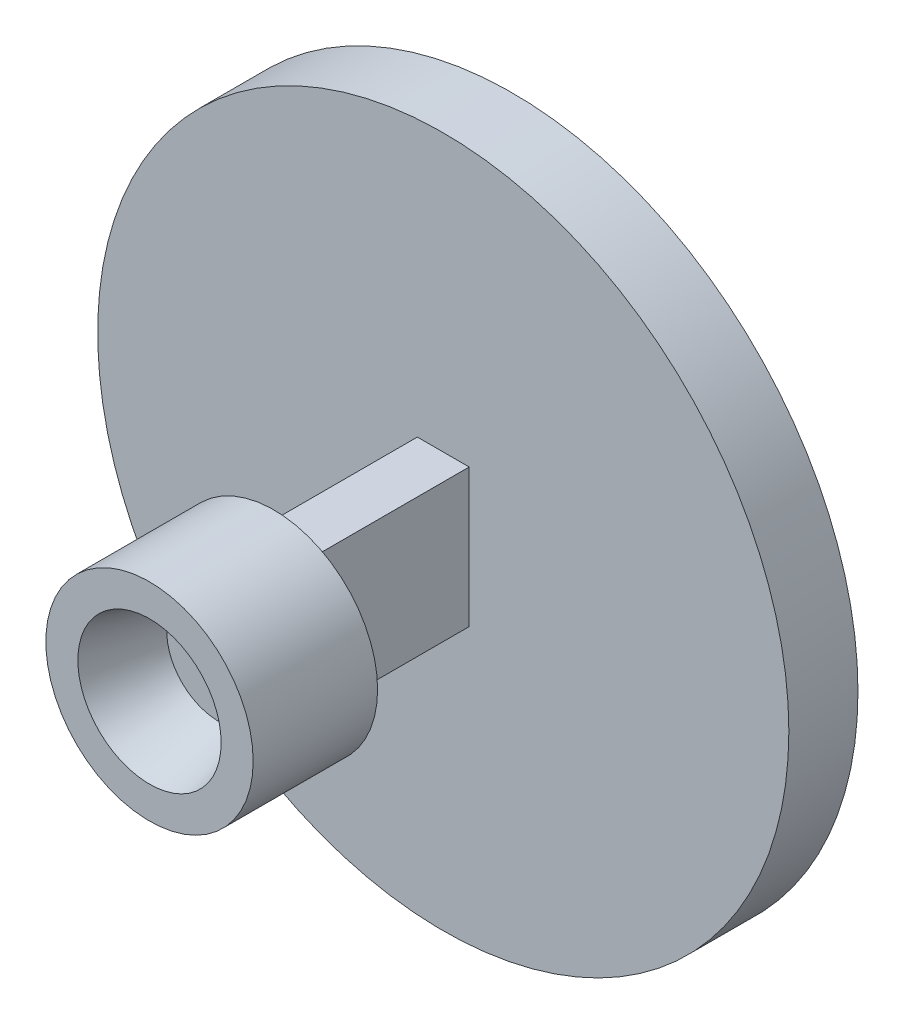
from build123d import *

# Parameters (mm, degrees)
SKETCH1_R                = 10
BOSS_EXTRUDE1_DEPTH      = 2
SKETCH2_W                = 1.5
SKETCH2_H                = 4
BOSS_EXTRUDE2_DEPTH      = 7
BOSS_EXTRUDE3_DEPTH      = 2
BOSS_EXTRUDE3_DEPTH_BACK = 1.6
SKETCH4_R                = 3
SKETCH4_3_R              = 1.5
CUT_EXTRUDE1_DEPTH       = 4
CUT_EXTRUDE1_DRAFT       = -16


with BuildPart() as part:
    # Sketch1 → Boss-Extrude1 (new body)
    with BuildSketch(Plane.XY):
        Circle(SKETCH1_R)
    extrude(amount=BOSS_EXTRUDE1_DEPTH)

    # Sketch2 → Boss-Extrude2 (add)
    with BuildSketch(Plane.XY):
        Rectangle(SKETCH2_W, SKETCH2_H)
    extrude(amount=BOSS_EXTRUDE2_DEPTH)

    # Sketch4 → Boss-Extrude3 (add, two sides: drawn at the far end of the back side and taken through both)
    with BuildSketch(Plane.XY.offset(8.5).offset(-BOSS_EXTRUDE3_DEPTH_BACK)):
        Circle(SKETCH4_R)
    extrude(amount=BOSS_EXTRUDE3_DEPTH + BOSS_EXTRUDE3_DEPTH_BACK)


with BuildPart() as cut_extrude1_tool:
    # Sketch4_3 → Cut-Extrude1 (with draft: the straight prism first)
    with BuildSketch(Plane.XY.offset(8.5)):
        Circle(SKETCH4_3_R)
    extrude(amount=CUT_EXTRUDE1_DEPTH)
    # Cut-Extrude1: the draft: its side faces are tilted about the plane it starts from
    cut_extrude1_sides = [cut_extrude1_tool.faces().sort_by_distance(p)[0] for p in [
        (-1.5, 0, 10.5),
    ]]
    draft(cut_extrude1_sides, Plane.XY.offset(8.5), CUT_EXTRUDE1_DRAFT)


with BuildPart() as part_1:
    add(part.part)

    # Cut-Extrude1: cut by cut_extrude1_tool
    add(cut_extrude1_tool.part, mode=Mode.SUBTRACT)


solid = part_1.part
